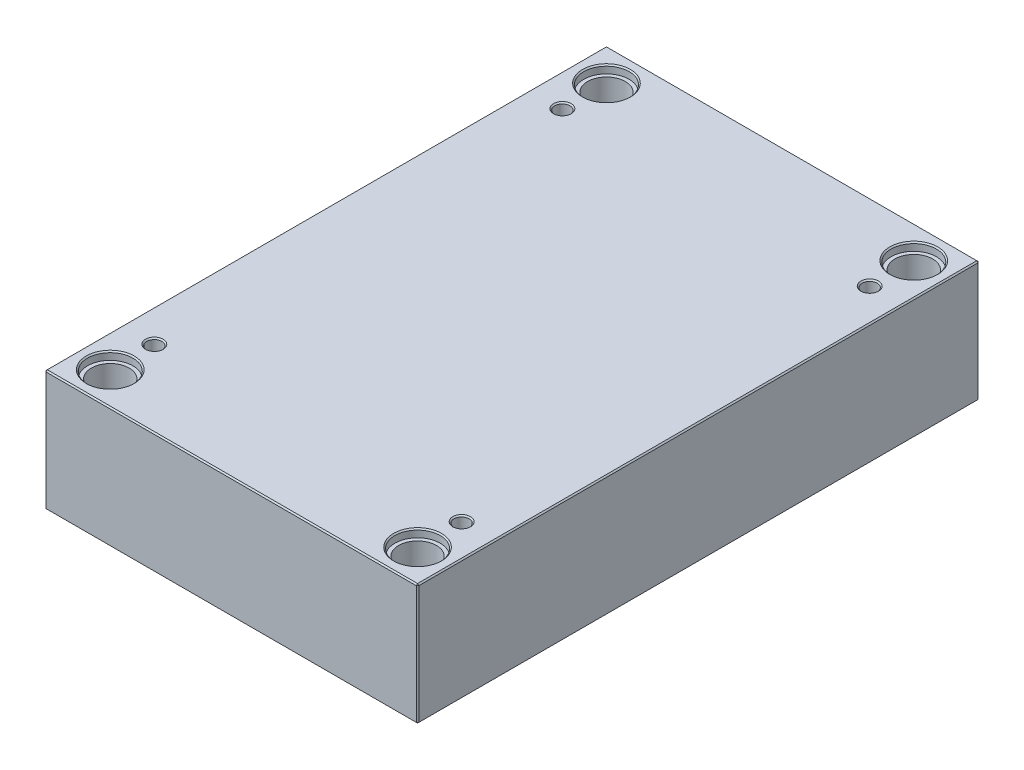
ISO-10303-21;
HEADER;
FILE_DESCRIPTION(('STEP AP214'),'2;1');
FILE_NAME('part.step','',(''),(''),'','','');
FILE_SCHEMA(('AUTOMOTIVE_DESIGN { 1 0 10303 214 1 1 1 1 }'));
ENDSEC;
DATA;
#1=APPLICATION_CONTEXT('core data for automotive mechanical design processes');
#2=APPLICATION_PROTOCOL_DEFINITION('international standard','automotive_design',2000,#1);
#3=PRODUCT_CONTEXT('',#1,'mechanical');
#4=PRODUCT('Part','Part','',(#3));
#5=PRODUCT_RELATED_PRODUCT_CATEGORY('part','',(#4));
#6=PRODUCT_DEFINITION_FORMATION('','',#4);
#7=PRODUCT_DEFINITION_CONTEXT('part definition',#1,'design');
#8=PRODUCT_DEFINITION('design','',#6,#7);
#9=PRODUCT_DEFINITION_SHAPE('','',#8);
#10=(LENGTH_UNIT() NAMED_UNIT(*) SI_UNIT(.MILLI.,.METRE.));
#11=(NAMED_UNIT(*) PLANE_ANGLE_UNIT() SI_UNIT($,.RADIAN.));
#12=(NAMED_UNIT(*) SI_UNIT($,.STERADIAN.) SOLID_ANGLE_UNIT());
#13=UNCERTAINTY_MEASURE_WITH_UNIT(LENGTH_MEASURE(1.E-05),#10,'distance_accuracy_value','');
#14=(GEOMETRIC_REPRESENTATION_CONTEXT(3) GLOBAL_UNCERTAINTY_ASSIGNED_CONTEXT((#13)) GLOBAL_UNIT_ASSIGNED_CONTEXT((#10,
#11,#12)) REPRESENTATION_CONTEXT('',''));
#15=CARTESIAN_POINT('',(0.,0.,0.));
#16=DIRECTION('',(0.,0.,1.));
#17=DIRECTION('',(1.,0.,0.));
#18=AXIS2_PLACEMENT_3D('',#15,#16,#17);
#19=CARTESIAN_POINT('',(-122.,0.,-197.));
#20=DIRECTION('',(0.,1.,0.));
#21=DIRECTION('',(0.,0.,1.));
#22=AXIS2_PLACEMENT_3D('',#19,#20,#21);
#23=CYLINDRICAL_SURFACE('',#22,15.);
#24=CARTESIAN_POINT('',(-122.,1.,-197.));
#25=DIRECTION('',(0.,1.,0.));
#26=DIRECTION('',(0.,0.,1.));
#27=AXIS2_PLACEMENT_3D('',#24,#25,#26);
#28=CIRCLE('',#27,15.);
#29=CARTESIAN_POINT('',(-122.,1.,-182.));
#30=VERTEX_POINT('',#29);
#31=EDGE_CURVE('E472',#30,#30,#28,.F.);
#32=ORIENTED_EDGE('',*,*,#31,.T.);
#33=EDGE_LOOP('',(#32));
#34=FACE_BOUND('',#33,.T.);
#35=CARTESIAN_POINT('',(-122.,89.7,-197.));
#36=DIRECTION('',(0.,1.,0.));
#37=DIRECTION('',(0.,0.,1.));
#38=AXIS2_PLACEMENT_3D('',#35,#36,#37);
#39=CIRCLE('',#38,15.);
#40=CARTESIAN_POINT('',(-122.,89.7,-182.));
#41=VERTEX_POINT('',#40);
#42=EDGE_CURVE('E221',#41,#41,#39,.F.);
#43=ORIENTED_EDGE('',*,*,#42,.F.);
#44=EDGE_LOOP('',(#43));
#45=FACE_BOUND('',#44,.T.);
#46=ADVANCED_FACE('F16',(#34,#45),#23,.F.);
#47=CARTESIAN_POINT('',(122.,0.,-197.));
#48=DIRECTION('',(0.,1.,0.));
#49=DIRECTION('',(0.,0.,1.));
#50=AXIS2_PLACEMENT_3D('',#47,#48,#49);
#51=CYLINDRICAL_SURFACE('',#50,15.);
#52=CARTESIAN_POINT('',(122.,1.00000000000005,-197.));
#53=DIRECTION('',(0.,1.,0.));
#54=DIRECTION('',(0.,0.,1.));
#55=AXIS2_PLACEMENT_3D('',#52,#53,#54);
#56=CIRCLE('',#55,15.);
#57=CARTESIAN_POINT('',(122.,1.00000000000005,-182.));
#58=VERTEX_POINT('',#57);
#59=EDGE_CURVE('E474',#58,#58,#56,.F.);
#60=ORIENTED_EDGE('',*,*,#59,.T.);
#61=EDGE_LOOP('',(#60));
#62=FACE_BOUND('',#61,.T.);
#63=CARTESIAN_POINT('',(122.,89.7,-197.));
#64=DIRECTION('',(0.,1.,0.));
#65=DIRECTION('',(0.,0.,1.));
#66=AXIS2_PLACEMENT_3D('',#63,#64,#65);
#67=CIRCLE('',#66,15.);
#68=CARTESIAN_POINT('',(122.,89.7,-182.));
#69=VERTEX_POINT('',#68);
#70=EDGE_CURVE('E218',#69,#69,#67,.F.);
#71=ORIENTED_EDGE('',*,*,#70,.F.);
#72=EDGE_LOOP('',(#71));
#73=FACE_BOUND('',#72,.T.);
#74=ADVANCED_FACE('F263',(#62,#73),#51,.F.);
#75=CARTESIAN_POINT('',(122.,0.,197.));
#76=DIRECTION('',(0.,1.,0.));
#77=DIRECTION('',(0.,0.,1.));
#78=AXIS2_PLACEMENT_3D('',#75,#76,#77);
#79=CYLINDRICAL_SURFACE('',#78,15.);
#80=CARTESIAN_POINT('',(122.,1.00000000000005,197.));
#81=DIRECTION('',(0.,1.,0.));
#82=DIRECTION('',(0.,0.,1.));
#83=AXIS2_PLACEMENT_3D('',#80,#81,#82);
#84=CIRCLE('',#83,15.);
#85=CARTESIAN_POINT('',(122.,1.00000000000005,212.));
#86=VERTEX_POINT('',#85);
#87=EDGE_CURVE('E477',#86,#86,#84,.F.);
#88=ORIENTED_EDGE('',*,*,#87,.T.);
#89=EDGE_LOOP('',(#88));
#90=FACE_BOUND('',#89,.T.);
#91=CARTESIAN_POINT('',(122.,89.7,197.));
#92=DIRECTION('',(0.,1.,0.));
#93=DIRECTION('',(0.,0.,1.));
#94=AXIS2_PLACEMENT_3D('',#91,#92,#93);
#95=CIRCLE('',#94,15.);
#96=CARTESIAN_POINT('',(122.,89.7,212.));
#97=VERTEX_POINT('',#96);
#98=EDGE_CURVE('E214',#97,#97,#95,.F.);
#99=ORIENTED_EDGE('',*,*,#98,.F.);
#100=EDGE_LOOP('',(#99));
#101=FACE_BOUND('',#100,.T.);
#102=ADVANCED_FACE('F270',(#90,#101),#79,.F.);
#103=CARTESIAN_POINT('',(-122.,0.,197.));
#104=DIRECTION('',(0.,1.,0.));
#105=DIRECTION('',(0.,0.,1.));
#106=AXIS2_PLACEMENT_3D('',#103,#104,#105);
#107=CYLINDRICAL_SURFACE('',#106,15.);
#108=CARTESIAN_POINT('',(-122.,1.,197.));
#109=DIRECTION('',(0.,1.,0.));
#110=DIRECTION('',(0.,0.,1.));
#111=AXIS2_PLACEMENT_3D('',#108,#109,#110);
#112=CIRCLE('',#111,15.);
#113=CARTESIAN_POINT('',(-122.,1.,212.));
#114=VERTEX_POINT('',#113);
#115=EDGE_CURVE('E480',#114,#114,#112,.F.);
#116=ORIENTED_EDGE('',*,*,#115,.T.);
#117=EDGE_LOOP('',(#116));
#118=FACE_BOUND('',#117,.T.);
#119=CARTESIAN_POINT('',(-122.,89.7,197.));
#120=DIRECTION('',(0.,1.,0.));
#121=DIRECTION('',(0.,0.,1.));
#122=AXIS2_PLACEMENT_3D('',#119,#120,#121);
#123=CIRCLE('',#122,15.);
#124=CARTESIAN_POINT('',(-122.,89.7,212.));
#125=VERTEX_POINT('',#124);
#126=EDGE_CURVE('E211',#125,#125,#123,.F.);
#127=ORIENTED_EDGE('',*,*,#126,.F.);
#128=EDGE_LOOP('',(#127));
#129=FACE_BOUND('',#128,.T.);
#130=ADVANCED_FACE('F277',(#118,#129),#107,.F.);
#131=CARTESIAN_POINT('',(-148.,96.,223.));
#132=DIRECTION('',(1.,0.,0.));
#133=DIRECTION('',(0.,0.,-1.));
#134=AXIS2_PLACEMENT_3D('',#131,#132,#133);
#135=PLANE('',#134);
#136=DIRECTION('',(0.,-1.,0.));
#137=VECTOR('',#136,1.);
#138=CARTESIAN_POINT('',(-148.,96.,-222.));
#139=LINE('',#138,#137);
#140=CARTESIAN_POINT('',(-148.,95.,-222.));
#141=VERTEX_POINT('',#140);
#142=CARTESIAN_POINT('',(-148.,1.,-222.));
#143=VERTEX_POINT('',#142);
#144=EDGE_CURVE('E487',#141,#143,#139,.T.);
#145=ORIENTED_EDGE('',*,*,#144,.T.);
#146=DIRECTION('',(0.,0.,1.));
#147=VECTOR('',#146,1.);
#148=CARTESIAN_POINT('',(-148.,1.,223.));
#149=LINE('',#148,#147);
#150=CARTESIAN_POINT('',(-148.,1.,222.));
#151=VERTEX_POINT('',#150);
#152=EDGE_CURVE('E490',#143,#151,#149,.T.);
#153=ORIENTED_EDGE('',*,*,#152,.T.);
#154=DIRECTION('',(0.,1.,0.));
#155=VECTOR('',#154,1.);
#156=CARTESIAN_POINT('',(-148.,96.,222.));
#157=LINE('',#156,#155);
#158=CARTESIAN_POINT('',(-148.,95.,222.));
#159=VERTEX_POINT('',#158);
#160=EDGE_CURVE('E485',#151,#159,#157,.T.);
#161=ORIENTED_EDGE('',*,*,#160,.T.);
#162=DIRECTION('',(0.,0.,-1.));
#163=VECTOR('',#162,1.);
#164=CARTESIAN_POINT('',(-148.,95.,-223.));
#165=LINE('',#164,#163);
#166=EDGE_CURVE('E483',#159,#141,#165,.T.);
#167=ORIENTED_EDGE('',*,*,#166,.T.);
#168=EDGE_LOOP('',(#145,#153,#161,#167));
#169=FACE_BOUND('',#168,.T.);
#170=ADVANCED_FACE('F298',(#169),#135,.F.);
#171=CARTESIAN_POINT('',(148.,96.,223.));
#172=DIRECTION('',(0.,0.,-1.));
#173=DIRECTION('',(-1.,0.,0.));
#174=AXIS2_PLACEMENT_3D('',#171,#172,#173);
#175=PLANE('',#174);
#176=DIRECTION('',(-1.,0.,0.));
#177=VECTOR('',#176,1.);
#178=CARTESIAN_POINT('',(-148.,95.,223.));
#179=LINE('',#178,#177);
#180=CARTESIAN_POINT('',(147.,95.,223.));
#181=VERTEX_POINT('',#180);
#182=CARTESIAN_POINT('',(-147.,95.,223.));
#183=VERTEX_POINT('',#182);
#184=EDGE_CURVE('E509',#181,#183,#179,.T.);
#185=ORIENTED_EDGE('',*,*,#184,.T.);
#186=DIRECTION('',(0.,-1.,0.));
#187=VECTOR('',#186,1.);
#188=CARTESIAN_POINT('',(-147.,96.,223.));
#189=LINE('',#188,#187);
#190=CARTESIAN_POINT('',(-147.,1.,223.));
#191=VERTEX_POINT('',#190);
#192=EDGE_CURVE('E515',#183,#191,#189,.T.);
#193=ORIENTED_EDGE('',*,*,#192,.T.);
#194=DIRECTION('',(1.,0.,0.));
#195=VECTOR('',#194,1.);
#196=CARTESIAN_POINT('',(148.,1.,223.));
#197=LINE('',#196,#195);
#198=CARTESIAN_POINT('',(147.,1.,223.));
#199=VERTEX_POINT('',#198);
#200=EDGE_CURVE('E513',#191,#199,#197,.T.);
#201=ORIENTED_EDGE('',*,*,#200,.T.);
#202=DIRECTION('',(0.,1.,0.));
#203=VECTOR('',#202,1.);
#204=CARTESIAN_POINT('',(147.,96.,223.));
#205=LINE('',#204,#203);
#206=EDGE_CURVE('E511',#199,#181,#205,.T.);
#207=ORIENTED_EDGE('',*,*,#206,.T.);
#208=EDGE_LOOP('',(#185,#193,#201,#207));
#209=FACE_BOUND('',#208,.T.);
#210=ADVANCED_FACE('F294',(#209),#175,.F.);
#211=CARTESIAN_POINT('',(148.,96.,223.));
#212=DIRECTION('',(-1.,0.,0.));
#213=DIRECTION('',(0.,0.,1.));
#214=AXIS2_PLACEMENT_3D('',#211,#212,#213);
#215=PLANE('',#214);
#216=DIRECTION('',(0.,0.,-1.));
#217=VECTOR('',#216,1.);
#218=CARTESIAN_POINT('',(148.,1.,223.));
#219=LINE('',#218,#217);
#220=CARTESIAN_POINT('',(148.,1.,222.));
#221=VERTEX_POINT('',#220);
#222=CARTESIAN_POINT('',(148.,1.,-222.));
#223=VERTEX_POINT('',#222);
#224=EDGE_CURVE('E504',#221,#223,#219,.T.);
#225=ORIENTED_EDGE('',*,*,#224,.T.);
#226=DIRECTION('',(0.,1.,0.));
#227=VECTOR('',#226,1.);
#228=CARTESIAN_POINT('',(148.,96.,-222.));
#229=LINE('',#228,#227);
#230=CARTESIAN_POINT('',(148.,95.,-222.));
#231=VERTEX_POINT('',#230);
#232=EDGE_CURVE('E506',#223,#231,#229,.T.);
#233=ORIENTED_EDGE('',*,*,#232,.T.);
#234=DIRECTION('',(0.,0.,1.));
#235=VECTOR('',#234,1.);
#236=CARTESIAN_POINT('',(148.,95.,223.));
#237=LINE('',#236,#235);
#238=CARTESIAN_POINT('',(148.,95.,222.));
#239=VERTEX_POINT('',#238);
#240=EDGE_CURVE('E500',#231,#239,#237,.T.);
#241=ORIENTED_EDGE('',*,*,#240,.T.);
#242=DIRECTION('',(0.,-1.,0.));
#243=VECTOR('',#242,1.);
#244=CARTESIAN_POINT('',(148.,96.,222.));
#245=LINE('',#244,#243);
#246=EDGE_CURVE('E502',#239,#221,#245,.T.);
#247=ORIENTED_EDGE('',*,*,#246,.T.);
#248=EDGE_LOOP('',(#225,#233,#241,#247));
#249=FACE_BOUND('',#248,.T.);
#250=ADVANCED_FACE('F290',(#249),#215,.F.);
#251=CARTESIAN_POINT('',(148.,96.,-223.));
#252=DIRECTION('',(0.,0.,1.));
#253=DIRECTION('',(1.,0.,0.));
#254=AXIS2_PLACEMENT_3D('',#251,#252,#253);
#255=PLANE('',#254);
#256=DIRECTION('',(0.,-1.,0.));
#257=VECTOR('',#256,1.);
#258=CARTESIAN_POINT('',(147.,96.,-223.));
#259=LINE('',#258,#257);
#260=CARTESIAN_POINT('',(147.,95.,-223.));
#261=VERTEX_POINT('',#260);
#262=CARTESIAN_POINT('',(147.,1.,-223.));
#263=VERTEX_POINT('',#262);
#264=EDGE_CURVE('E494',#261,#263,#259,.T.);
#265=ORIENTED_EDGE('',*,*,#264,.T.);
#266=DIRECTION('',(-1.,0.,0.));
#267=VECTOR('',#266,1.);
#268=CARTESIAN_POINT('',(148.,1.,-223.));
#269=LINE('',#268,#267);
#270=CARTESIAN_POINT('',(-147.,1.,-223.));
#271=VERTEX_POINT('',#270);
#272=EDGE_CURVE('E138',#263,#271,#269,.T.);
#273=ORIENTED_EDGE('',*,*,#272,.T.);
#274=DIRECTION('',(0.,1.,0.));
#275=VECTOR('',#274,1.);
#276=CARTESIAN_POINT('',(-147.,96.,-223.));
#277=LINE('',#276,#275);
#278=CARTESIAN_POINT('',(-147.,95.,-223.));
#279=VERTEX_POINT('',#278);
#280=EDGE_CURVE('E496',#271,#279,#277,.T.);
#281=ORIENTED_EDGE('',*,*,#280,.T.);
#282=DIRECTION('',(1.,0.,0.));
#283=VECTOR('',#282,1.);
#284=CARTESIAN_POINT('',(148.,95.,-223.));
#285=LINE('',#284,#283);
#286=EDGE_CURVE('E492',#279,#261,#285,.T.);
#287=ORIENTED_EDGE('',*,*,#286,.T.);
#288=EDGE_LOOP('',(#265,#273,#281,#287));
#289=FACE_BOUND('',#288,.T.);
#290=ADVANCED_FACE('F282',(#289),#255,.F.);
#291=CARTESIAN_POINT('',(0.,96.,0.));
#292=DIRECTION('',(0.,1.,0.));
#293=DIRECTION('',(0.,0.,1.));
#294=AXIS2_PLACEMENT_3D('',#291,#292,#293);
#295=PLANE('',#294);
#296=CARTESIAN_POINT('',(122.,96.,197.));
#297=DIRECTION('',(0.,1.,0.));
#298=DIRECTION('',(0.,0.,1.));
#299=AXIS2_PLACEMENT_3D('',#296,#297,#298);
#300=CIRCLE('',#299,19.);
#301=CARTESIAN_POINT('',(122.,96.,216.));
#302=VERTEX_POINT('',#301);
#303=EDGE_CURVE('E236',#302,#302,#300,.F.);
#304=ORIENTED_EDGE('',*,*,#303,.T.);
#305=EDGE_LOOP('',(#304));
#306=FACE_BOUND('',#305,.T.);
#307=CARTESIAN_POINT('',(-122.,96.,197.));
#308=DIRECTION('',(0.,1.,0.));
#309=DIRECTION('',(0.,0.,1.));
#310=AXIS2_PLACEMENT_3D('',#307,#308,#309);
#311=CIRCLE('',#310,19.);
#312=CARTESIAN_POINT('',(-122.,96.,216.));
#313=VERTEX_POINT('',#312);
#314=EDGE_CURVE('E233',#313,#313,#311,.F.);
#315=ORIENTED_EDGE('',*,*,#314,.T.);
#316=EDGE_LOOP('',(#315));
#317=FACE_BOUND('',#316,.T.);
#318=CARTESIAN_POINT('',(122.,96.,-197.));
#319=DIRECTION('',(0.,1.,0.));
#320=DIRECTION('',(0.,0.,1.));
#321=AXIS2_PLACEMENT_3D('',#318,#319,#320);
#322=CIRCLE('',#321,19.);
#323=CARTESIAN_POINT('',(122.,96.,-178.));
#324=VERTEX_POINT('',#323);
#325=EDGE_CURVE('E230',#324,#324,#322,.F.);
#326=ORIENTED_EDGE('',*,*,#325,.T.);
#327=EDGE_LOOP('',(#326));
#328=FACE_BOUND('',#327,.T.);
#329=CARTESIAN_POINT('',(-122.,96.,-197.));
#330=DIRECTION('',(0.,1.,0.));
#331=DIRECTION('',(0.,0.,1.));
#332=AXIS2_PLACEMENT_3D('',#329,#330,#331);
#333=CIRCLE('',#332,19.);
#334=CARTESIAN_POINT('',(-122.,96.,-178.));
#335=VERTEX_POINT('',#334);
#336=EDGE_CURVE('E227',#335,#335,#333,.F.);
#337=ORIENTED_EDGE('',*,*,#336,.T.);
#338=EDGE_LOOP('',(#337));
#339=FACE_BOUND('',#338,.T.);
#340=CARTESIAN_POINT('',(-122.,96.,162.));
#341=DIRECTION('',(0.,1.,0.));
#342=DIRECTION('',(0.,0.,1.));
#343=AXIS2_PLACEMENT_3D('',#340,#341,#342);
#344=CIRCLE('',#343,7.);
#345=CARTESIAN_POINT('',(-122.,96.,169.));
#346=VERTEX_POINT('',#345);
#347=EDGE_CURVE('E198',#346,#346,#344,.F.);
#348=ORIENTED_EDGE('',*,*,#347,.T.);
#349=EDGE_LOOP('',(#348));
#350=FACE_BOUND('',#349,.T.);
#351=CARTESIAN_POINT('',(122.,96.,162.));
#352=DIRECTION('',(0.,1.,0.));
#353=DIRECTION('',(0.,0.,1.));
#354=AXIS2_PLACEMENT_3D('',#351,#352,#353);
#355=CIRCLE('',#354,7.00000000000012);
#356=CARTESIAN_POINT('',(122.,96.,169.));
#357=VERTEX_POINT('',#356);
#358=EDGE_CURVE('E195',#357,#357,#355,.F.);
#359=ORIENTED_EDGE('',*,*,#358,.T.);
#360=EDGE_LOOP('',(#359));
#361=FACE_BOUND('',#360,.T.);
#362=CARTESIAN_POINT('',(122.,96.,-162.));
#363=DIRECTION('',(0.,1.,0.));
#364=DIRECTION('',(0.,0.,1.));
#365=AXIS2_PLACEMENT_3D('',#362,#363,#364);
#366=CIRCLE('',#365,7.00000000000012);
#367=CARTESIAN_POINT('',(122.,96.,-155.));
#368=VERTEX_POINT('',#367);
#369=EDGE_CURVE('E192',#368,#368,#366,.F.);
#370=ORIENTED_EDGE('',*,*,#369,.T.);
#371=EDGE_LOOP('',(#370));
#372=FACE_BOUND('',#371,.T.);
#373=CARTESIAN_POINT('',(-122.,96.,-162.));
#374=DIRECTION('',(0.,1.,0.));
#375=DIRECTION('',(0.,0.,1.));
#376=AXIS2_PLACEMENT_3D('',#373,#374,#375);
#377=CIRCLE('',#376,7.);
#378=CARTESIAN_POINT('',(-122.,96.,-155.));
#379=VERTEX_POINT('',#378);
#380=EDGE_CURVE('E188',#379,#379,#377,.F.);
#381=ORIENTED_EDGE('',*,*,#380,.T.);
#382=EDGE_LOOP('',(#381));
#383=FACE_BOUND('',#382,.T.);
#384=DIRECTION('',(0.,0.,-1.));
#385=VECTOR('',#384,1.);
#386=CARTESIAN_POINT('',(147.,96.,-223.));
#387=LINE('',#386,#385);
#388=CARTESIAN_POINT('',(147.,96.,222.));
#389=VERTEX_POINT('',#388);
#390=CARTESIAN_POINT('',(147.,96.,-222.));
#391=VERTEX_POINT('',#390);
#392=EDGE_CURVE('E31',#389,#391,#387,.T.);
#393=ORIENTED_EDGE('',*,*,#392,.T.);
#394=DIRECTION('',(-1.,0.,0.));
#395=VECTOR('',#394,1.);
#396=CARTESIAN_POINT('',(-148.,96.,-222.));
#397=LINE('',#396,#395);
#398=CARTESIAN_POINT('',(-147.,96.,-222.));
#399=VERTEX_POINT('',#398);
#400=EDGE_CURVE('E189',#391,#399,#397,.T.);
#401=ORIENTED_EDGE('',*,*,#400,.T.);
#402=DIRECTION('',(0.,0.,1.));
#403=VECTOR('',#402,1.);
#404=CARTESIAN_POINT('',(-147.,96.,223.));
#405=LINE('',#404,#403);
#406=CARTESIAN_POINT('',(-147.,96.,222.));
#407=VERTEX_POINT('',#406);
#408=EDGE_CURVE('E518',#399,#407,#405,.T.);
#409=ORIENTED_EDGE('',*,*,#408,.T.);
#410=DIRECTION('',(1.,0.,0.));
#411=VECTOR('',#410,1.);
#412=CARTESIAN_POINT('',(148.,96.,222.));
#413=LINE('',#412,#411);
#414=EDGE_CURVE('E36',#407,#389,#413,.T.);
#415=ORIENTED_EDGE('',*,*,#414,.T.);
#416=EDGE_LOOP('',(#393,#401,#409,#415));
#417=FACE_BOUND('',#416,.T.);
#418=ADVANCED_FACE('F279',(#306,#317,#328,#339,#350,#361,#372,#383,#417),#295,.T.);
#419=CARTESIAN_POINT('',(0.,0.,0.));
#420=DIRECTION('',(0.,1.,0.));
#421=DIRECTION('',(0.,0.,1.));
#422=AXIS2_PLACEMENT_3D('',#419,#420,#421);
#423=PLANE('',#422);
#424=CARTESIAN_POINT('',(-122.,0.,-197.));
#425=DIRECTION('',(0.,1.,0.));
#426=DIRECTION('',(0.,0.,1.));
#427=AXIS2_PLACEMENT_3D('',#424,#425,#426);
#428=CIRCLE('',#427,16.);
#429=CARTESIAN_POINT('',(-122.,0.,-181.));
#430=VERTEX_POINT('',#429);
#431=EDGE_CURVE('E469',#430,#430,#428,.T.);
#432=ORIENTED_EDGE('',*,*,#431,.T.);
#433=EDGE_LOOP('',(#432));
#434=FACE_BOUND('',#433,.T.);
#435=CARTESIAN_POINT('',(122.,0.,-197.));
#436=DIRECTION('',(0.,1.,0.));
#437=DIRECTION('',(0.,0.,1.));
#438=AXIS2_PLACEMENT_3D('',#435,#436,#437);
#439=CIRCLE('',#438,16.);
#440=CARTESIAN_POINT('',(122.,0.,-181.));
#441=VERTEX_POINT('',#440);
#442=EDGE_CURVE('E466',#441,#441,#439,.T.);
#443=ORIENTED_EDGE('',*,*,#442,.T.);
#444=EDGE_LOOP('',(#443));
#445=FACE_BOUND('',#444,.T.);
#446=CARTESIAN_POINT('',(122.,0.,197.));
#447=DIRECTION('',(0.,1.,0.));
#448=DIRECTION('',(0.,0.,1.));
#449=AXIS2_PLACEMENT_3D('',#446,#447,#448);
#450=CIRCLE('',#449,16.);
#451=CARTESIAN_POINT('',(122.,0.,213.));
#452=VERTEX_POINT('',#451);
#453=EDGE_CURVE('E463',#452,#452,#450,.T.);
#454=ORIENTED_EDGE('',*,*,#453,.T.);
#455=EDGE_LOOP('',(#454));
#456=FACE_BOUND('',#455,.T.);
#457=CARTESIAN_POINT('',(-122.,0.,197.));
#458=DIRECTION('',(0.,1.,0.));
#459=DIRECTION('',(0.,0.,1.));
#460=AXIS2_PLACEMENT_3D('',#457,#458,#459);
#461=CIRCLE('',#460,16.);
#462=CARTESIAN_POINT('',(-122.,0.,213.));
#463=VERTEX_POINT('',#462);
#464=EDGE_CURVE('E460',#463,#463,#461,.T.);
#465=ORIENTED_EDGE('',*,*,#464,.T.);
#466=EDGE_LOOP('',(#465));
#467=FACE_BOUND('',#466,.T.);
#468=DIRECTION('',(0.,0.,1.));
#469=VECTOR('',#468,1.);
#470=CARTESIAN_POINT('',(147.,0.,0.));
#471=LINE('',#470,#469);
#472=CARTESIAN_POINT('',(147.,0.,-222.));
#473=VERTEX_POINT('',#472);
#474=CARTESIAN_POINT('',(147.,0.,222.));
#475=VERTEX_POINT('',#474);
#476=EDGE_CURVE('E108',#473,#475,#471,.T.);
#477=ORIENTED_EDGE('',*,*,#476,.T.);
#478=DIRECTION('',(-1.,0.,0.));
#479=VECTOR('',#478,1.);
#480=CARTESIAN_POINT('',(0.,0.,222.));
#481=LINE('',#480,#479);
#482=CARTESIAN_POINT('',(-147.,0.,222.));
#483=VERTEX_POINT('',#482);
#484=EDGE_CURVE('E458',#475,#483,#481,.T.);
#485=ORIENTED_EDGE('',*,*,#484,.T.);
#486=DIRECTION('',(0.,0.,-1.));
#487=VECTOR('',#486,1.);
#488=CARTESIAN_POINT('',(-147.,0.,0.));
#489=LINE('',#488,#487);
#490=CARTESIAN_POINT('',(-147.,0.,-222.));
#491=VERTEX_POINT('',#490);
#492=EDGE_CURVE('E110',#483,#491,#489,.T.);
#493=ORIENTED_EDGE('',*,*,#492,.T.);
#494=DIRECTION('',(1.,0.,0.));
#495=VECTOR('',#494,1.);
#496=CARTESIAN_POINT('',(0.,0.,-222.));
#497=LINE('',#496,#495);
#498=EDGE_CURVE('E104',#491,#473,#497,.T.);
#499=ORIENTED_EDGE('',*,*,#498,.T.);
#500=EDGE_LOOP('',(#477,#485,#493,#499));
#501=FACE_BOUND('',#500,.T.);
#502=ADVANCED_FACE('F106',(#434,#445,#456,#467,#501),#423,.F.);
#503=CARTESIAN_POINT('',(-122.,0.,-197.));
#504=DIRECTION('',(0.,-1.,0.));
#505=DIRECTION('',(0.,0.,-1.));
#506=AXIS2_PLACEMENT_3D('',#503,#504,#505);
#507=CONICAL_SURFACE('',#506,16.,0.78539816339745);
#508=ORIENTED_EDGE('',*,*,#31,.F.);
#509=EDGE_LOOP('',(#508));
#510=FACE_BOUND('',#509,.T.);
#511=ORIENTED_EDGE('',*,*,#431,.F.);
#512=EDGE_LOOP('',(#511));
#513=FACE_BOUND('',#512,.T.);
#514=ADVANCED_FACE('F286',(#510,#513),#507,.F.);
#515=CARTESIAN_POINT('',(122.,0.,-197.));
#516=DIRECTION('',(0.,-1.,0.));
#517=DIRECTION('',(0.,0.,-1.));
#518=AXIS2_PLACEMENT_3D('',#515,#516,#517);
#519=CONICAL_SURFACE('',#518,16.,0.78539816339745);
#520=ORIENTED_EDGE('',*,*,#59,.F.);
#521=EDGE_LOOP('',(#520));
#522=FACE_BOUND('',#521,.T.);
#523=ORIENTED_EDGE('',*,*,#442,.F.);
#524=EDGE_LOOP('',(#523));
#525=FACE_BOUND('',#524,.T.);
#526=ADVANCED_FACE('F305',(#522,#525),#519,.F.);
#527=CARTESIAN_POINT('',(122.,0.,197.));
#528=DIRECTION('',(0.,-1.,0.));
#529=DIRECTION('',(0.,0.,-1.));
#530=AXIS2_PLACEMENT_3D('',#527,#528,#529);
#531=CONICAL_SURFACE('',#530,16.,0.78539816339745);
#532=ORIENTED_EDGE('',*,*,#87,.F.);
#533=EDGE_LOOP('',(#532));
#534=FACE_BOUND('',#533,.T.);
#535=ORIENTED_EDGE('',*,*,#453,.F.);
#536=EDGE_LOOP('',(#535));
#537=FACE_BOUND('',#536,.T.);
#538=ADVANCED_FACE('F309',(#534,#537),#531,.F.);
#539=CARTESIAN_POINT('',(-122.,0.,197.));
#540=DIRECTION('',(0.,-1.,0.));
#541=DIRECTION('',(0.,0.,-1.));
#542=AXIS2_PLACEMENT_3D('',#539,#540,#541);
#543=CONICAL_SURFACE('',#542,16.,0.78539816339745);
#544=ORIENTED_EDGE('',*,*,#115,.F.);
#545=EDGE_LOOP('',(#544));
#546=FACE_BOUND('',#545,.T.);
#547=ORIENTED_EDGE('',*,*,#464,.F.);
#548=EDGE_LOOP('',(#547));
#549=FACE_BOUND('',#548,.T.);
#550=ADVANCED_FACE('F313',(#546,#549),#543,.F.);
#551=CARTESIAN_POINT('',(148.,96.,222.));
#552=DIRECTION('',(-0.707106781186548,0.,-0.707106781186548));
#553=DIRECTION('',(0.,-1.,0.));
#554=AXIS2_PLACEMENT_3D('',#551,#552,#553);
#555=PLANE('',#554);
#556=DIRECTION('',(-0.707106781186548,0.,0.707106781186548));
#557=VECTOR('',#556,1.);
#558=CARTESIAN_POINT('',(147.,95.,223.));
#559=LINE('',#558,#557);
#560=EDGE_CURVE('E126',#181,#239,#559,.F.);
#561=ORIENTED_EDGE('',*,*,#560,.F.);
#562=ORIENTED_EDGE('',*,*,#206,.F.);
#563=DIRECTION('',(0.707106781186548,0.,-0.707106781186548));
#564=VECTOR('',#563,1.);
#565=CARTESIAN_POINT('',(147.,1.,223.));
#566=LINE('',#565,#564);
#567=EDGE_CURVE('E180',#221,#199,#566,.F.);
#568=ORIENTED_EDGE('',*,*,#567,.F.);
#569=ORIENTED_EDGE('',*,*,#246,.F.);
#570=EDGE_LOOP('',(#561,#562,#568,#569));
#571=FACE_BOUND('',#570,.T.);
#572=ADVANCED_FACE('F317',(#571),#555,.F.);
#573=CARTESIAN_POINT('',(147.,95.,223.));
#574=DIRECTION('',(0.577350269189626,0.577350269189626,0.577350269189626));
#575=DIRECTION('',(0.707106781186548,0.,-0.707106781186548));
#576=AXIS2_PLACEMENT_3D('',#573,#574,#575);
#577=PLANE('',#576);
#578=DIRECTION('',(0.,-0.707106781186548,0.707106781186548));
#579=VECTOR('',#578,1.);
#580=CARTESIAN_POINT('',(147.,95.,223.));
#581=LINE('',#580,#579);
#582=EDGE_CURVE('E175',#181,#389,#581,.F.);
#583=ORIENTED_EDGE('',*,*,#582,.F.);
#584=ORIENTED_EDGE('',*,*,#560,.T.);
#585=DIRECTION('',(-0.707106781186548,0.707106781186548,0.));
#586=VECTOR('',#585,1.);
#587=CARTESIAN_POINT('',(147.5,95.5,222.));
#588=LINE('',#587,#586);
#589=EDGE_CURVE('E177',#389,#239,#588,.F.);
#590=ORIENTED_EDGE('',*,*,#589,.F.);
#591=EDGE_LOOP('',(#583,#584,#590));
#592=FACE_BOUND('',#591,.T.);
#593=ADVANCED_FACE('F385',(#592),#577,.T.);
#594=CARTESIAN_POINT('',(147.,1.,223.));
#595=DIRECTION('',(0.577350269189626,-0.577350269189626,0.577350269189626));
#596=DIRECTION('',(0.707106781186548,0.,-0.707106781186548));
#597=AXIS2_PLACEMENT_3D('',#594,#595,#596);
#598=PLANE('',#597);
#599=DIRECTION('',(-0.707106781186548,-0.707106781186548,0.));
#600=VECTOR('',#599,1.);
#601=CARTESIAN_POINT('',(147.5,0.5,222.));
#602=LINE('',#601,#600);
#603=EDGE_CURVE('E124',#221,#475,#602,.T.);
#604=ORIENTED_EDGE('',*,*,#603,.F.);
#605=ORIENTED_EDGE('',*,*,#567,.T.);
#606=DIRECTION('',(0.,0.707106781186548,0.707106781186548));
#607=VECTOR('',#606,1.);
#608=CARTESIAN_POINT('',(147.,1.,223.));
#609=LINE('',#608,#607);
#610=EDGE_CURVE('E172',#475,#199,#609,.T.);
#611=ORIENTED_EDGE('',*,*,#610,.F.);
#612=EDGE_LOOP('',(#604,#605,#611));
#613=FACE_BOUND('',#612,.T.);
#614=ADVANCED_FACE('F381',(#613),#598,.T.);
#615=CARTESIAN_POINT('',(147.,96.,0.));
#616=DIRECTION('',(0.707106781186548,0.707106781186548,0.));
#617=DIRECTION('',(0.,0.,1.));
#618=AXIS2_PLACEMENT_3D('',#615,#616,#617);
#619=PLANE('',#618);
#620=ORIENTED_EDGE('',*,*,#589,.T.);
#621=ORIENTED_EDGE('',*,*,#240,.F.);
#622=DIRECTION('',(0.707106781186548,-0.707106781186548,0.));
#623=VECTOR('',#622,1.);
#624=CARTESIAN_POINT('',(148.,95.,-222.));
#625=LINE('',#624,#623);
#626=EDGE_CURVE('E166',#391,#231,#625,.T.);
#627=ORIENTED_EDGE('',*,*,#626,.F.);
#628=ORIENTED_EDGE('',*,*,#392,.F.);
#629=EDGE_LOOP('',(#620,#621,#627,#628));
#630=FACE_BOUND('',#629,.T.);
#631=ADVANCED_FACE('F377',(#630),#619,.T.);
#632=CARTESIAN_POINT('',(0.,96.,222.));
#633=DIRECTION('',(0.,0.707106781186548,0.707106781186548));
#634=DIRECTION('',(-1.,0.,0.));
#635=AXIS2_PLACEMENT_3D('',#632,#633,#634);
#636=PLANE('',#635);
#637=ORIENTED_EDGE('',*,*,#582,.T.);
#638=ORIENTED_EDGE('',*,*,#414,.F.);
#639=DIRECTION('',(0.,0.707106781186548,-0.707106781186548));
#640=VECTOR('',#639,1.);
#641=CARTESIAN_POINT('',(-147.,95.5,222.5));
#642=LINE('',#641,#640);
#643=EDGE_CURVE('E163',#183,#407,#642,.T.);
#644=ORIENTED_EDGE('',*,*,#643,.F.);
#645=ORIENTED_EDGE('',*,*,#184,.F.);
#646=EDGE_LOOP('',(#637,#638,#644,#645));
#647=FACE_BOUND('',#646,.T.);
#648=ADVANCED_FACE('F373',(#647),#636,.T.);
#649=CARTESIAN_POINT('',(-147.,96.,223.));
#650=DIRECTION('',(0.707106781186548,0.,-0.707106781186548));
#651=DIRECTION('',(0.,-1.,0.));
#652=AXIS2_PLACEMENT_3D('',#649,#650,#651);
#653=PLANE('',#652);
#654=DIRECTION('',(0.707106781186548,0.,0.707106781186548));
#655=VECTOR('',#654,1.);
#656=CARTESIAN_POINT('',(-147.,1.,223.));
#657=LINE('',#656,#655);
#658=EDGE_CURVE('E157',#191,#151,#657,.F.);
#659=ORIENTED_EDGE('',*,*,#658,.F.);
#660=ORIENTED_EDGE('',*,*,#192,.F.);
#661=DIRECTION('',(-0.707106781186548,0.,-0.707106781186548));
#662=VECTOR('',#661,1.);
#663=CARTESIAN_POINT('',(-148.,95.,222.));
#664=LINE('',#663,#662);
#665=EDGE_CURVE('E160',#159,#183,#664,.F.);
#666=ORIENTED_EDGE('',*,*,#665,.F.);
#667=ORIENTED_EDGE('',*,*,#160,.F.);
#668=EDGE_LOOP('',(#659,#660,#666,#667));
#669=FACE_BOUND('',#668,.T.);
#670=ADVANCED_FACE('F369',(#669),#653,.F.);
#671=CARTESIAN_POINT('',(148.,1.,223.));
#672=DIRECTION('',(0.,0.707106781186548,-0.707106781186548));
#673=DIRECTION('',(1.,0.,0.));
#674=AXIS2_PLACEMENT_3D('',#671,#672,#673);
#675=PLANE('',#674);
#676=ORIENTED_EDGE('',*,*,#610,.T.);
#677=ORIENTED_EDGE('',*,*,#200,.F.);
#678=DIRECTION('',(0.,-0.707106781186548,-0.707106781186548));
#679=VECTOR('',#678,1.);
#680=CARTESIAN_POINT('',(-147.,1.,223.));
#681=LINE('',#680,#679);
#682=EDGE_CURVE('E135',#483,#191,#681,.F.);
#683=ORIENTED_EDGE('',*,*,#682,.F.);
#684=ORIENTED_EDGE('',*,*,#484,.F.);
#685=EDGE_LOOP('',(#676,#677,#683,#684));
#686=FACE_BOUND('',#685,.T.);
#687=ADVANCED_FACE('F366',(#686),#675,.F.);
#688=CARTESIAN_POINT('',(148.,1.,223.));
#689=DIRECTION('',(-0.707106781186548,0.707106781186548,0.));
#690=DIRECTION('',(0.,0.,-1.));
#691=AXIS2_PLACEMENT_3D('',#688,#689,#690);
#692=PLANE('',#691);
#693=ORIENTED_EDGE('',*,*,#603,.T.);
#694=ORIENTED_EDGE('',*,*,#476,.F.);
#695=DIRECTION('',(0.707106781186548,0.707106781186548,0.));
#696=VECTOR('',#695,1.);
#697=CARTESIAN_POINT('',(147.5,0.5,-222.));
#698=LINE('',#697,#696);
#699=EDGE_CURVE('E121',#223,#473,#698,.F.);
#700=ORIENTED_EDGE('',*,*,#699,.F.);
#701=ORIENTED_EDGE('',*,*,#224,.F.);
#702=EDGE_LOOP('',(#693,#694,#700,#701));
#703=FACE_BOUND('',#702,.T.);
#704=ADVANCED_FACE('F119',(#703),#692,.F.);
#705=CARTESIAN_POINT('',(147.,96.,-223.));
#706=DIRECTION('',(-0.707106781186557,0.,0.707106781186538));
#707=DIRECTION('',(0.,-1.,0.));
#708=AXIS2_PLACEMENT_3D('',#705,#706,#707);
#709=PLANE('',#708);
#710=DIRECTION('',(0.707106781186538,0.,0.707106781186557));
#711=VECTOR('',#710,1.);
#712=CARTESIAN_POINT('',(148.,95.,-222.));
#713=LINE('',#712,#711);
#714=EDGE_CURVE('E168',#231,#261,#713,.F.);
#715=ORIENTED_EDGE('',*,*,#714,.F.);
#716=ORIENTED_EDGE('',*,*,#232,.F.);
#717=DIRECTION('',(-0.707106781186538,0.,-0.707106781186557));
#718=VECTOR('',#717,1.);
#719=CARTESIAN_POINT('',(147.,1.,-223.));
#720=LINE('',#719,#718);
#721=EDGE_CURVE('E134',#263,#223,#720,.F.);
#722=ORIENTED_EDGE('',*,*,#721,.F.);
#723=ORIENTED_EDGE('',*,*,#264,.F.);
#724=EDGE_LOOP('',(#715,#716,#722,#723));
#725=FACE_BOUND('',#724,.T.);
#726=ADVANCED_FACE('F359',(#725),#709,.F.);
#727=CARTESIAN_POINT('',(148.,95.,-222.));
#728=DIRECTION('',(0.577350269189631,0.577350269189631,-0.577350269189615));
#729=DIRECTION('',(-0.707106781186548,0.707106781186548,0.));
#730=AXIS2_PLACEMENT_3D('',#727,#728,#729);
#731=PLANE('',#730);
#732=ORIENTED_EDGE('',*,*,#626,.T.);
#733=ORIENTED_EDGE('',*,*,#714,.T.);
#734=DIRECTION('',(0.,0.707106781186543,0.707106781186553));
#735=VECTOR('',#734,1.);
#736=CARTESIAN_POINT('',(147.,95.5,-222.5));
#737=LINE('',#736,#735);
#738=EDGE_CURVE('E152',#391,#261,#737,.F.);
#739=ORIENTED_EDGE('',*,*,#738,.F.);
#740=EDGE_LOOP('',(#732,#733,#739));
#741=FACE_BOUND('',#740,.T.);
#742=ADVANCED_FACE('F355',(#741),#731,.T.);
#743=CARTESIAN_POINT('',(-148.,95.,222.));
#744=DIRECTION('',(-0.577350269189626,0.577350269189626,0.577350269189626));
#745=DIRECTION('',(0.707106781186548,0.,0.707106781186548));
#746=AXIS2_PLACEMENT_3D('',#743,#744,#745);
#747=PLANE('',#746);
#748=ORIENTED_EDGE('',*,*,#665,.T.);
#749=ORIENTED_EDGE('',*,*,#643,.T.);
#750=DIRECTION('',(-0.707106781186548,-0.707106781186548,0.));
#751=VECTOR('',#750,1.);
#752=CARTESIAN_POINT('',(-148.,95.,222.));
#753=LINE('',#752,#751);
#754=EDGE_CURVE('E143',#159,#407,#753,.F.);
#755=ORIENTED_EDGE('',*,*,#754,.F.);
#756=EDGE_LOOP('',(#748,#749,#755));
#757=FACE_BOUND('',#756,.T.);
#758=ADVANCED_FACE('F351',(#757),#747,.T.);
#759=CARTESIAN_POINT('',(-147.,1.,223.));
#760=DIRECTION('',(-0.577350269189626,-0.577350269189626,0.577350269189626));
#761=DIRECTION('',(0.707106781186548,0.,0.707106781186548));
#762=AXIS2_PLACEMENT_3D('',#759,#760,#761);
#763=PLANE('',#762);
#764=ORIENTED_EDGE('',*,*,#682,.T.);
#765=ORIENTED_EDGE('',*,*,#658,.T.);
#766=DIRECTION('',(-0.707106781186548,0.707106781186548,0.));
#767=VECTOR('',#766,1.);
#768=CARTESIAN_POINT('',(-147.5,0.5,222.));
#769=LINE('',#768,#767);
#770=EDGE_CURVE('E139',#483,#151,#769,.T.);
#771=ORIENTED_EDGE('',*,*,#770,.F.);
#772=EDGE_LOOP('',(#764,#765,#771));
#773=FACE_BOUND('',#772,.T.);
#774=ADVANCED_FACE('F348',(#773),#763,.T.);
#775=CARTESIAN_POINT('',(147.,1.,-223.));
#776=DIRECTION('',(0.577350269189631,-0.577350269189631,-0.577350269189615));
#777=DIRECTION('',(0.707106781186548,0.707106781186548,0.));
#778=AXIS2_PLACEMENT_3D('',#775,#776,#777);
#779=PLANE('',#778);
#780=ORIENTED_EDGE('',*,*,#721,.T.);
#781=ORIENTED_EDGE('',*,*,#699,.T.);
#782=DIRECTION('',(0.,-0.707106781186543,0.707106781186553));
#783=VECTOR('',#782,1.);
#784=CARTESIAN_POINT('',(147.,1.,-223.));
#785=LINE('',#784,#783);
#786=EDGE_CURVE('E131',#263,#473,#785,.T.);
#787=ORIENTED_EDGE('',*,*,#786,.F.);
#788=EDGE_LOOP('',(#780,#781,#787));
#789=FACE_BOUND('',#788,.T.);
#790=ADVANCED_FACE('F130',(#789),#779,.T.);
#791=CARTESIAN_POINT('',(0.,96.,-222.));
#792=DIRECTION('',(0.,0.707106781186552,-0.707106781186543));
#793=DIRECTION('',(1.,0.,0.));
#794=AXIS2_PLACEMENT_3D('',#791,#792,#793);
#795=PLANE('',#794);
#796=ORIENTED_EDGE('',*,*,#738,.T.);
#797=ORIENTED_EDGE('',*,*,#286,.F.);
#798=DIRECTION('',(0.,-0.707106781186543,-0.707106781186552));
#799=VECTOR('',#798,1.);
#800=CARTESIAN_POINT('',(-147.,95.,-223.));
#801=LINE('',#800,#799);
#802=EDGE_CURVE('E140',#399,#279,#801,.T.);
#803=ORIENTED_EDGE('',*,*,#802,.F.);
#804=ORIENTED_EDGE('',*,*,#400,.F.);
#805=EDGE_LOOP('',(#796,#797,#803,#804));
#806=FACE_BOUND('',#805,.T.);
#807=ADVANCED_FACE('F341',(#806),#795,.T.);
#808=CARTESIAN_POINT('',(-147.,96.,0.));
#809=DIRECTION('',(-0.707106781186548,0.707106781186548,0.));
#810=DIRECTION('',(0.,0.,-1.));
#811=AXIS2_PLACEMENT_3D('',#808,#809,#810);
#812=PLANE('',#811);
#813=ORIENTED_EDGE('',*,*,#754,.T.);
#814=ORIENTED_EDGE('',*,*,#408,.F.);
#815=DIRECTION('',(0.707106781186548,0.707106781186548,0.));
#816=VECTOR('',#815,1.);
#817=CARTESIAN_POINT('',(-147.5,95.5,-222.));
#818=LINE('',#817,#816);
#819=EDGE_CURVE('E146',#141,#399,#818,.T.);
#820=ORIENTED_EDGE('',*,*,#819,.F.);
#821=ORIENTED_EDGE('',*,*,#166,.F.);
#822=EDGE_LOOP('',(#813,#814,#820,#821));
#823=FACE_BOUND('',#822,.T.);
#824=ADVANCED_FACE('F337',(#823),#812,.T.);
#825=CARTESIAN_POINT('',(-148.,1.,223.));
#826=DIRECTION('',(0.707106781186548,0.707106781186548,0.));
#827=DIRECTION('',(0.,0.,1.));
#828=AXIS2_PLACEMENT_3D('',#825,#826,#827);
#829=PLANE('',#828);
#830=ORIENTED_EDGE('',*,*,#770,.T.);
#831=ORIENTED_EDGE('',*,*,#152,.F.);
#832=DIRECTION('',(0.707106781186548,-0.707106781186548,0.));
#833=VECTOR('',#832,1.);
#834=CARTESIAN_POINT('',(-148.,1.,-222.));
#835=LINE('',#834,#833);
#836=EDGE_CURVE('E529',#491,#143,#835,.F.);
#837=ORIENTED_EDGE('',*,*,#836,.F.);
#838=ORIENTED_EDGE('',*,*,#492,.F.);
#839=EDGE_LOOP('',(#830,#831,#837,#838));
#840=FACE_BOUND('',#839,.T.);
#841=ADVANCED_FACE('F334',(#840),#829,.F.);
#842=CARTESIAN_POINT('',(148.,1.,-223.));
#843=DIRECTION('',(0.,0.707106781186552,0.707106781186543));
#844=DIRECTION('',(-1.,0.,0.));
#845=AXIS2_PLACEMENT_3D('',#842,#843,#844);
#846=PLANE('',#845);
#847=ORIENTED_EDGE('',*,*,#786,.T.);
#848=ORIENTED_EDGE('',*,*,#498,.F.);
#849=DIRECTION('',(0.,0.707106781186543,-0.707106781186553));
#850=VECTOR('',#849,1.);
#851=CARTESIAN_POINT('',(-147.,0.500000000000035,-222.5));
#852=LINE('',#851,#850);
#853=EDGE_CURVE('E526',#271,#491,#852,.F.);
#854=ORIENTED_EDGE('',*,*,#853,.F.);
#855=ORIENTED_EDGE('',*,*,#272,.F.);
#856=EDGE_LOOP('',(#847,#848,#854,#855));
#857=FACE_BOUND('',#856,.T.);
#858=ADVANCED_FACE('F137',(#857),#846,.F.);
#859=CARTESIAN_POINT('',(-147.,95.,-223.));
#860=DIRECTION('',(-0.577350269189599,0.577350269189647,-0.577350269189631));
#861=DIRECTION('',(0.,0.707106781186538,0.707106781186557));
#862=AXIS2_PLACEMENT_3D('',#859,#860,#861);
#863=PLANE('',#862);
#864=ORIENTED_EDGE('',*,*,#819,.T.);
#865=ORIENTED_EDGE('',*,*,#802,.T.);
#866=DIRECTION('',(0.707106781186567,0.,-0.707106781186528));
#867=VECTOR('',#866,1.);
#868=CARTESIAN_POINT('',(-147.,95.,-223.));
#869=LINE('',#868,#867);
#870=EDGE_CURVE('E524',#141,#279,#869,.T.);
#871=ORIENTED_EDGE('',*,*,#870,.F.);
#872=EDGE_LOOP('',(#864,#865,#871));
#873=FACE_BOUND('',#872,.T.);
#874=ADVANCED_FACE('F327',(#873),#863,.T.);
#875=CARTESIAN_POINT('',(-148.,1.,-222.));
#876=DIRECTION('',(-0.577350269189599,-0.577350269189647,-0.577350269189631));
#877=DIRECTION('',(0.,0.707106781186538,-0.707106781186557));
#878=AXIS2_PLACEMENT_3D('',#875,#876,#877);
#879=PLANE('',#878);
#880=ORIENTED_EDGE('',*,*,#853,.T.);
#881=ORIENTED_EDGE('',*,*,#836,.T.);
#882=DIRECTION('',(-0.707106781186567,0.,0.707106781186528));
#883=VECTOR('',#882,1.);
#884=CARTESIAN_POINT('',(-148.,1.,-222.));
#885=LINE('',#884,#883);
#886=EDGE_CURVE('E455',#271,#143,#885,.T.);
#887=ORIENTED_EDGE('',*,*,#886,.F.);
#888=EDGE_LOOP('',(#880,#881,#887));
#889=FACE_BOUND('',#888,.T.);
#890=ADVANCED_FACE('F323',(#889),#879,.T.);
#891=CARTESIAN_POINT('',(-148.,96.,-222.));
#892=DIRECTION('',(0.707106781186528,0.,0.707106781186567));
#893=DIRECTION('',(0.,-1.,0.));
#894=AXIS2_PLACEMENT_3D('',#891,#892,#893);
#895=PLANE('',#894);
#896=ORIENTED_EDGE('',*,*,#870,.T.);
#897=ORIENTED_EDGE('',*,*,#280,.F.);
#898=ORIENTED_EDGE('',*,*,#886,.T.);
#899=ORIENTED_EDGE('',*,*,#144,.F.);
#900=EDGE_LOOP('',(#896,#897,#898,#899));
#901=FACE_BOUND('',#900,.T.);
#902=ADVANCED_FACE('F319',(#901),#895,.F.);
#903=CARTESIAN_POINT('',(-122.,72.,-162.));
#904=DIRECTION('',(0.,1.,0.));
#905=DIRECTION('',(0.,0.,1.));
#906=AXIS2_PLACEMENT_3D('',#903,#904,#905);
#907=CYLINDRICAL_SURFACE('',#906,6.);
#908=CARTESIAN_POINT('',(-122.,95.,-162.));
#909=DIRECTION('',(0.,1.,0.));
#910=DIRECTION('',(0.,0.,1.));
#911=AXIS2_PLACEMENT_3D('',#908,#909,#910);
#912=CIRCLE('',#911,6.);
#913=CARTESIAN_POINT('',(-122.,95.,-156.));
#914=VERTEX_POINT('',#913);
#915=EDGE_CURVE('E207',#914,#914,#912,.T.);
#916=ORIENTED_EDGE('',*,*,#915,.T.);
#917=EDGE_LOOP('',(#916));
#918=FACE_BOUND('',#917,.T.);
#919=CARTESIAN_POINT('',(-122.,72.,-162.));
#920=DIRECTION('',(0.,1.,0.));
#921=DIRECTION('',(0.,0.,1.));
#922=AXIS2_PLACEMENT_3D('',#919,#920,#921);
#923=CIRCLE('',#922,6.);
#924=CARTESIAN_POINT('',(-122.,72.,-156.));
#925=VERTEX_POINT('',#924);
#926=EDGE_CURVE('E448',#925,#925,#923,.T.);
#927=ORIENTED_EDGE('',*,*,#926,.F.);
#928=EDGE_LOOP('',(#927));
#929=FACE_BOUND('',#928,.T.);
#930=ADVANCED_FACE('F322',(#918,#929),#907,.F.);
#931=CARTESIAN_POINT('',(-122.,72.,-162.));
#932=DIRECTION('',(0.,1.,0.));
#933=DIRECTION('',(0.,0.,1.));
#934=AXIS2_PLACEMENT_3D('',#931,#932,#933);
#935=PLANE('',#934);
#936=ORIENTED_EDGE('',*,*,#926,.T.);
#937=EDGE_LOOP('',(#936));
#938=FACE_BOUND('',#937,.T.);
#939=ADVANCED_FACE('F596',(#938),#935,.T.);
#940=CARTESIAN_POINT('',(122.,72.,-162.));
#941=DIRECTION('',(0.,1.,0.));
#942=DIRECTION('',(0.,0.,1.));
#943=AXIS2_PLACEMENT_3D('',#940,#941,#942);
#944=CYLINDRICAL_SURFACE('',#943,6.);
#945=CARTESIAN_POINT('',(122.,95.,-162.));
#946=DIRECTION('',(0.,1.,0.));
#947=DIRECTION('',(0.,0.,1.));
#948=AXIS2_PLACEMENT_3D('',#945,#946,#947);
#949=CIRCLE('',#948,6.);
#950=CARTESIAN_POINT('',(122.,95.,-156.));
#951=VERTEX_POINT('',#950);
#952=EDGE_CURVE('E204',#951,#951,#949,.T.);
#953=ORIENTED_EDGE('',*,*,#952,.T.);
#954=EDGE_LOOP('',(#953));
#955=FACE_BOUND('',#954,.T.);
#956=CARTESIAN_POINT('',(122.,72.,-162.));
#957=DIRECTION('',(0.,1.,0.));
#958=DIRECTION('',(0.,0.,1.));
#959=AXIS2_PLACEMENT_3D('',#956,#957,#958);
#960=CIRCLE('',#959,6.);
#961=CARTESIAN_POINT('',(122.,72.,-156.));
#962=VERTEX_POINT('',#961);
#963=EDGE_CURVE('E445',#962,#962,#960,.T.);
#964=ORIENTED_EDGE('',*,*,#963,.F.);
#965=EDGE_LOOP('',(#964));
#966=FACE_BOUND('',#965,.T.);
#967=ADVANCED_FACE('F592',(#955,#966),#944,.F.);
#968=CARTESIAN_POINT('',(122.,72.,-162.));
#969=DIRECTION('',(0.,1.,0.));
#970=DIRECTION('',(0.,0.,1.));
#971=AXIS2_PLACEMENT_3D('',#968,#969,#970);
#972=PLANE('',#971);
#973=ORIENTED_EDGE('',*,*,#963,.T.);
#974=EDGE_LOOP('',(#973));
#975=FACE_BOUND('',#974,.T.);
#976=ADVANCED_FACE('F588',(#975),#972,.T.);
#977=CARTESIAN_POINT('',(122.,72.,162.));
#978=DIRECTION('',(0.,1.,0.));
#979=DIRECTION('',(0.,0.,1.));
#980=AXIS2_PLACEMENT_3D('',#977,#978,#979);
#981=CYLINDRICAL_SURFACE('',#980,6.);
#982=CARTESIAN_POINT('',(122.,95.,162.));
#983=DIRECTION('',(0.,1.,0.));
#984=DIRECTION('',(0.,0.,1.));
#985=AXIS2_PLACEMENT_3D('',#982,#983,#984);
#986=CIRCLE('',#985,6.);
#987=CARTESIAN_POINT('',(122.,95.,168.));
#988=VERTEX_POINT('',#987);
#989=EDGE_CURVE('E201',#988,#988,#986,.T.);
#990=ORIENTED_EDGE('',*,*,#989,.T.);
#991=EDGE_LOOP('',(#990));
#992=FACE_BOUND('',#991,.T.);
#993=CARTESIAN_POINT('',(122.,72.,162.));
#994=DIRECTION('',(0.,1.,0.));
#995=DIRECTION('',(0.,0.,1.));
#996=AXIS2_PLACEMENT_3D('',#993,#994,#995);
#997=CIRCLE('',#996,6.);
#998=CARTESIAN_POINT('',(122.,72.,168.));
#999=VERTEX_POINT('',#998);
#1000=EDGE_CURVE('E449',#999,#999,#997,.T.);
#1001=ORIENTED_EDGE('',*,*,#1000,.F.);
#1002=EDGE_LOOP('',(#1001));
#1003=FACE_BOUND('',#1002,.T.);
#1004=ADVANCED_FACE('F591',(#992,#1003),#981,.F.);
#1005=CARTESIAN_POINT('',(122.,72.,162.));
#1006=DIRECTION('',(0.,1.,0.));
#1007=DIRECTION('',(0.,0.,1.));
#1008=AXIS2_PLACEMENT_3D('',#1005,#1006,#1007);
#1009=PLANE('',#1008);
#1010=ORIENTED_EDGE('',*,*,#1000,.T.);
#1011=EDGE_LOOP('',(#1010));
#1012=FACE_BOUND('',#1011,.T.);
#1013=ADVANCED_FACE('F598',(#1012),#1009,.T.);
#1014=CARTESIAN_POINT('',(-122.,72.,162.));
#1015=DIRECTION('',(0.,1.,0.));
#1016=DIRECTION('',(0.,0.,1.));
#1017=AXIS2_PLACEMENT_3D('',#1014,#1015,#1016);
#1018=CYLINDRICAL_SURFACE('',#1017,6.);
#1019=CARTESIAN_POINT('',(-122.,95.,162.));
#1020=DIRECTION('',(0.,1.,0.));
#1021=DIRECTION('',(0.,0.,1.));
#1022=AXIS2_PLACEMENT_3D('',#1019,#1020,#1021);
#1023=CIRCLE('',#1022,6.);
#1024=CARTESIAN_POINT('',(-122.,95.,168.));
#1025=VERTEX_POINT('',#1024);
#1026=EDGE_CURVE('E185',#1025,#1025,#1023,.T.);
#1027=ORIENTED_EDGE('',*,*,#1026,.T.);
#1028=EDGE_LOOP('',(#1027));
#1029=FACE_BOUND('',#1028,.T.);
#1030=CARTESIAN_POINT('',(-122.,72.,162.));
#1031=DIRECTION('',(0.,1.,0.));
#1032=DIRECTION('',(0.,0.,1.));
#1033=AXIS2_PLACEMENT_3D('',#1030,#1031,#1032);
#1034=CIRCLE('',#1033,6.);
#1035=CARTESIAN_POINT('',(-122.,72.,168.));
#1036=VERTEX_POINT('',#1035);
#1037=EDGE_CURVE('E224',#1036,#1036,#1034,.T.);
#1038=ORIENTED_EDGE('',*,*,#1037,.F.);
#1039=EDGE_LOOP('',(#1038));
#1040=FACE_BOUND('',#1039,.T.);
#1041=ADVANCED_FACE('F601',(#1029,#1040),#1018,.F.);
#1042=CARTESIAN_POINT('',(-122.,72.,162.));
#1043=DIRECTION('',(0.,1.,0.));
#1044=DIRECTION('',(0.,0.,1.));
#1045=AXIS2_PLACEMENT_3D('',#1042,#1043,#1044);
#1046=PLANE('',#1045);
#1047=ORIENTED_EDGE('',*,*,#1037,.T.);
#1048=EDGE_LOOP('',(#1047));
#1049=FACE_BOUND('',#1048,.T.);
#1050=ADVANCED_FACE('F397',(#1049),#1046,.T.);
#1051=CARTESIAN_POINT('',(-122.,95.,162.));
#1052=DIRECTION('',(0.,1.,0.));
#1053=DIRECTION('',(0.,0.,1.));
#1054=AXIS2_PLACEMENT_3D('',#1051,#1052,#1053);
#1055=CONICAL_SURFACE('',#1054,6.,0.785398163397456);
#1056=ORIENTED_EDGE('',*,*,#347,.F.);
#1057=EDGE_LOOP('',(#1056));
#1058=FACE_BOUND('',#1057,.T.);
#1059=ORIENTED_EDGE('',*,*,#1026,.F.);
#1060=EDGE_LOOP('',(#1059));
#1061=FACE_BOUND('',#1060,.T.);
#1062=ADVANCED_FACE('F393',(#1058,#1061),#1055,.F.);
#1063=CARTESIAN_POINT('',(122.,95.,162.));
#1064=DIRECTION('',(0.,1.,0.));
#1065=DIRECTION('',(0.,0.,1.));
#1066=AXIS2_PLACEMENT_3D('',#1063,#1064,#1065);
#1067=CONICAL_SURFACE('',#1066,6.,0.785398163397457);
#1068=ORIENTED_EDGE('',*,*,#358,.F.);
#1069=EDGE_LOOP('',(#1068));
#1070=FACE_BOUND('',#1069,.T.);
#1071=ORIENTED_EDGE('',*,*,#989,.F.);
#1072=EDGE_LOOP('',(#1071));
#1073=FACE_BOUND('',#1072,.T.);
#1074=ADVANCED_FACE('F396',(#1070,#1073),#1067,.F.);
#1075=CARTESIAN_POINT('',(122.,95.,-162.));
#1076=DIRECTION('',(0.,1.,0.));
#1077=DIRECTION('',(0.,0.,1.));
#1078=AXIS2_PLACEMENT_3D('',#1075,#1076,#1077);
#1079=CONICAL_SURFACE('',#1078,6.,0.785398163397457);
#1080=ORIENTED_EDGE('',*,*,#369,.F.);
#1081=EDGE_LOOP('',(#1080));
#1082=FACE_BOUND('',#1081,.T.);
#1083=ORIENTED_EDGE('',*,*,#952,.F.);
#1084=EDGE_LOOP('',(#1083));
#1085=FACE_BOUND('',#1084,.T.);
#1086=ADVANCED_FACE('F401',(#1082,#1085),#1079,.F.);
#1087=CARTESIAN_POINT('',(-122.,95.,-162.));
#1088=DIRECTION('',(0.,1.,0.));
#1089=DIRECTION('',(0.,0.,1.));
#1090=AXIS2_PLACEMENT_3D('',#1087,#1088,#1089);
#1091=CONICAL_SURFACE('',#1090,6.,0.785398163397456);
#1092=ORIENTED_EDGE('',*,*,#380,.F.);
#1093=EDGE_LOOP('',(#1092));
#1094=FACE_BOUND('',#1093,.T.);
#1095=ORIENTED_EDGE('',*,*,#915,.F.);
#1096=EDGE_LOOP('',(#1095));
#1097=FACE_BOUND('',#1096,.T.);
#1098=ADVANCED_FACE('F405',(#1094,#1097),#1091,.F.);
#1099=CARTESIAN_POINT('',(-122.,89.7,197.));
#1100=DIRECTION('',(0.,1.,0.));
#1101=DIRECTION('',(0.,0.,1.));
#1102=AXIS2_PLACEMENT_3D('',#1099,#1100,#1101);
#1103=PLANE('',#1102);
#1104=CARTESIAN_POINT('',(-122.,89.7,197.));
#1105=DIRECTION('',(0.,1.,0.));
#1106=DIRECTION('',(0.,0.,1.));
#1107=AXIS2_PLACEMENT_3D('',#1104,#1105,#1106);
#1108=CIRCLE('',#1107,18.);
#1109=CARTESIAN_POINT('',(-122.,89.7,215.));
#1110=VERTEX_POINT('',#1109);
#1111=EDGE_CURVE('E436',#1110,#1110,#1108,.T.);
#1112=ORIENTED_EDGE('',*,*,#1111,.T.);
#1113=EDGE_LOOP('',(#1112));
#1114=FACE_BOUND('',#1113,.T.);
#1115=ORIENTED_EDGE('',*,*,#126,.T.);
#1116=EDGE_LOOP('',(#1115));
#1117=FACE_BOUND('',#1116,.T.);
#1118=ADVANCED_FACE('F409',(#1114,#1117),#1103,.T.);
#1119=CARTESIAN_POINT('',(-122.,89.7,197.));
#1120=DIRECTION('',(0.,1.,0.));
#1121=DIRECTION('',(0.,0.,1.));
#1122=AXIS2_PLACEMENT_3D('',#1119,#1120,#1121);
#1123=CYLINDRICAL_SURFACE('',#1122,18.);
#1124=CARTESIAN_POINT('',(-122.,95.,197.));
#1125=DIRECTION('',(0.,1.,0.));
#1126=DIRECTION('',(0.,0.,1.));
#1127=AXIS2_PLACEMENT_3D('',#1124,#1125,#1126);
#1128=CIRCLE('',#1127,18.);
#1129=CARTESIAN_POINT('',(-122.,95.,215.));
#1130=VERTEX_POINT('',#1129);
#1131=EDGE_CURVE('E239',#1130,#1130,#1128,.T.);
#1132=ORIENTED_EDGE('',*,*,#1131,.T.);
#1133=EDGE_LOOP('',(#1132));
#1134=FACE_BOUND('',#1133,.T.);
#1135=ORIENTED_EDGE('',*,*,#1111,.F.);
#1136=EDGE_LOOP('',(#1135));
#1137=FACE_BOUND('',#1136,.T.);
#1138=ADVANCED_FACE('F574',(#1134,#1137),#1123,.F.);
#1139=CARTESIAN_POINT('',(122.,89.7,197.));
#1140=DIRECTION('',(0.,1.,0.));
#1141=DIRECTION('',(0.,0.,1.));
#1142=AXIS2_PLACEMENT_3D('',#1139,#1140,#1141);
#1143=PLANE('',#1142);
#1144=CARTESIAN_POINT('',(122.,89.7,197.));
#1145=DIRECTION('',(0.,1.,0.));
#1146=DIRECTION('',(0.,0.,1.));
#1147=AXIS2_PLACEMENT_3D('',#1144,#1145,#1146);
#1148=CIRCLE('',#1147,18.);
#1149=CARTESIAN_POINT('',(122.,89.7,215.));
#1150=VERTEX_POINT('',#1149);
#1151=EDGE_CURVE('E433',#1150,#1150,#1148,.T.);
#1152=ORIENTED_EDGE('',*,*,#1151,.T.);
#1153=EDGE_LOOP('',(#1152));
#1154=FACE_BOUND('',#1153,.T.);
#1155=ORIENTED_EDGE('',*,*,#98,.T.);
#1156=EDGE_LOOP('',(#1155));
#1157=FACE_BOUND('',#1156,.T.);
#1158=ADVANCED_FACE('F429',(#1154,#1157),#1143,.T.);
#1159=CARTESIAN_POINT('',(122.,89.7,197.));
#1160=DIRECTION('',(0.,1.,0.));
#1161=DIRECTION('',(0.,0.,1.));
#1162=AXIS2_PLACEMENT_3D('',#1159,#1160,#1161);
#1163=CYLINDRICAL_SURFACE('',#1162,18.);
#1164=CARTESIAN_POINT('',(122.,95.,197.));
#1165=DIRECTION('',(0.,1.,0.));
#1166=DIRECTION('',(0.,0.,1.));
#1167=AXIS2_PLACEMENT_3D('',#1164,#1165,#1166);
#1168=CIRCLE('',#1167,18.);
#1169=CARTESIAN_POINT('',(122.,95.,215.));
#1170=VERTEX_POINT('',#1169);
#1171=EDGE_CURVE('E210',#1170,#1170,#1168,.T.);
#1172=ORIENTED_EDGE('',*,*,#1171,.T.);
#1173=EDGE_LOOP('',(#1172));
#1174=FACE_BOUND('',#1173,.T.);
#1175=ORIENTED_EDGE('',*,*,#1151,.F.);
#1176=EDGE_LOOP('',(#1175));
#1177=FACE_BOUND('',#1176,.T.);
#1178=ADVANCED_FACE('F425',(#1174,#1177),#1163,.F.);
#1179=CARTESIAN_POINT('',(122.,89.7,-197.));
#1180=DIRECTION('',(0.,1.,0.));
#1181=DIRECTION('',(0.,0.,1.));
#1182=AXIS2_PLACEMENT_3D('',#1179,#1180,#1181);
#1183=PLANE('',#1182);
#1184=CARTESIAN_POINT('',(122.,89.7,-197.));
#1185=DIRECTION('',(0.,1.,0.));
#1186=DIRECTION('',(0.,0.,1.));
#1187=AXIS2_PLACEMENT_3D('',#1184,#1185,#1186);
#1188=CIRCLE('',#1187,18.);
#1189=CARTESIAN_POINT('',(122.,89.7,-179.));
#1190=VERTEX_POINT('',#1189);
#1191=EDGE_CURVE('E435',#1190,#1190,#1188,.T.);
#1192=ORIENTED_EDGE('',*,*,#1191,.T.);
#1193=EDGE_LOOP('',(#1192));
#1194=FACE_BOUND('',#1193,.T.);
#1195=ORIENTED_EDGE('',*,*,#70,.T.);
#1196=EDGE_LOOP('',(#1195));
#1197=FACE_BOUND('',#1196,.T.);
#1198=ADVANCED_FACE('F428',(#1194,#1197),#1183,.T.);
#1199=CARTESIAN_POINT('',(122.,89.7,-197.));
#1200=DIRECTION('',(0.,1.,0.));
#1201=DIRECTION('',(0.,0.,1.));
#1202=AXIS2_PLACEMENT_3D('',#1199,#1200,#1201);
#1203=CYLINDRICAL_SURFACE('',#1202,18.);
#1204=CARTESIAN_POINT('',(122.,95.,-197.));
#1205=DIRECTION('',(0.,1.,0.));
#1206=DIRECTION('',(0.,0.,1.));
#1207=AXIS2_PLACEMENT_3D('',#1204,#1205,#1206);
#1208=CIRCLE('',#1207,18.);
#1209=CARTESIAN_POINT('',(122.,95.,-179.));
#1210=VERTEX_POINT('',#1209);
#1211=EDGE_CURVE('E24',#1210,#1210,#1208,.T.);
#1212=ORIENTED_EDGE('',*,*,#1211,.T.);
#1213=EDGE_LOOP('',(#1212));
#1214=FACE_BOUND('',#1213,.T.);
#1215=ORIENTED_EDGE('',*,*,#1191,.F.);
#1216=EDGE_LOOP('',(#1215));
#1217=FACE_BOUND('',#1216,.T.);
#1218=ADVANCED_FACE('F244',(#1214,#1217),#1203,.F.);
#1219=CARTESIAN_POINT('',(-122.,89.7,-197.));
#1220=DIRECTION('',(0.,1.,0.));
#1221=DIRECTION('',(0.,0.,1.));
#1222=AXIS2_PLACEMENT_3D('',#1219,#1220,#1221);
#1223=PLANE('',#1222);
#1224=CARTESIAN_POINT('',(-122.,89.7,-197.));
#1225=DIRECTION('',(0.,1.,0.));
#1226=DIRECTION('',(0.,0.,1.));
#1227=AXIS2_PLACEMENT_3D('',#1224,#1225,#1226);
#1228=CIRCLE('',#1227,18.);
#1229=CARTESIAN_POINT('',(-122.,89.7,-179.));
#1230=VERTEX_POINT('',#1229);
#1231=EDGE_CURVE('E215',#1230,#1230,#1228,.T.);
#1232=ORIENTED_EDGE('',*,*,#1231,.T.);
#1233=EDGE_LOOP('',(#1232));
#1234=FACE_BOUND('',#1233,.T.);
#1235=ORIENTED_EDGE('',*,*,#42,.T.);
#1236=EDGE_LOOP('',(#1235));
#1237=FACE_BOUND('',#1236,.T.);
#1238=ADVANCED_FACE('F418',(#1234,#1237),#1223,.T.);
#1239=CARTESIAN_POINT('',(-122.,89.7,-197.));
#1240=DIRECTION('',(0.,1.,0.));
#1241=DIRECTION('',(0.,0.,1.));
#1242=AXIS2_PLACEMENT_3D('',#1239,#1240,#1241);
#1243=CYLINDRICAL_SURFACE('',#1242,18.);
#1244=CARTESIAN_POINT('',(-122.,95.,-197.));
#1245=DIRECTION('',(0.,1.,0.));
#1246=DIRECTION('',(0.,0.,1.));
#1247=AXIS2_PLACEMENT_3D('',#1244,#1245,#1246);
#1248=CIRCLE('',#1247,18.);
#1249=CARTESIAN_POINT('',(-122.,95.,-179.));
#1250=VERTEX_POINT('',#1249);
#1251=EDGE_CURVE('E10',#1250,#1250,#1248,.T.);
#1252=ORIENTED_EDGE('',*,*,#1251,.T.);
#1253=EDGE_LOOP('',(#1252));
#1254=FACE_BOUND('',#1253,.T.);
#1255=ORIENTED_EDGE('',*,*,#1231,.F.);
#1256=EDGE_LOOP('',(#1255));
#1257=FACE_BOUND('',#1256,.T.);
#1258=ADVANCED_FACE('F412',(#1254,#1257),#1243,.F.);
#1259=CARTESIAN_POINT('',(122.,95.,197.));
#1260=DIRECTION('',(0.,1.,0.));
#1261=DIRECTION('',(0.,0.,1.));
#1262=AXIS2_PLACEMENT_3D('',#1259,#1260,#1261);
#1263=CONICAL_SURFACE('',#1262,18.,0.785398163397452);
#1264=ORIENTED_EDGE('',*,*,#303,.F.);
#1265=EDGE_LOOP('',(#1264));
#1266=FACE_BOUND('',#1265,.T.);
#1267=ORIENTED_EDGE('',*,*,#1171,.F.);
#1268=EDGE_LOOP('',(#1267));
#1269=FACE_BOUND('',#1268,.T.);
#1270=ADVANCED_FACE('F258',(#1266,#1269),#1263,.F.);
#1271=CARTESIAN_POINT('',(-122.,95.,197.));
#1272=DIRECTION('',(0.,1.,0.));
#1273=DIRECTION('',(0.,0.,1.));
#1274=AXIS2_PLACEMENT_3D('',#1271,#1272,#1273);
#1275=CONICAL_SURFACE('',#1274,18.,0.785398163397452);
#1276=ORIENTED_EDGE('',*,*,#314,.F.);
#1277=EDGE_LOOP('',(#1276));
#1278=FACE_BOUND('',#1277,.T.);
#1279=ORIENTED_EDGE('',*,*,#1131,.F.);
#1280=EDGE_LOOP('',(#1279));
#1281=FACE_BOUND('',#1280,.T.);
#1282=ADVANCED_FACE('F249',(#1278,#1281),#1275,.F.);
#1283=CARTESIAN_POINT('',(122.,95.,-197.));
#1284=DIRECTION('',(0.,1.,0.));
#1285=DIRECTION('',(0.,0.,1.));
#1286=AXIS2_PLACEMENT_3D('',#1283,#1284,#1285);
#1287=CONICAL_SURFACE('',#1286,18.,0.785398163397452);
#1288=ORIENTED_EDGE('',*,*,#325,.F.);
#1289=EDGE_LOOP('',(#1288));
#1290=FACE_BOUND('',#1289,.T.);
#1291=ORIENTED_EDGE('',*,*,#1211,.F.);
#1292=EDGE_LOOP('',(#1291));
#1293=FACE_BOUND('',#1292,.T.);
#1294=ADVANCED_FACE('F247',(#1290,#1293),#1287,.F.);
#1295=CARTESIAN_POINT('',(-122.,95.,-197.));
#1296=DIRECTION('',(0.,1.,0.));
#1297=DIRECTION('',(0.,0.,1.));
#1298=AXIS2_PLACEMENT_3D('',#1295,#1296,#1297);
#1299=CONICAL_SURFACE('',#1298,18.,0.785398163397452);
#1300=ORIENTED_EDGE('',*,*,#336,.F.);
#1301=EDGE_LOOP('',(#1300));
#1302=FACE_BOUND('',#1301,.T.);
#1303=ORIENTED_EDGE('',*,*,#1251,.F.);
#1304=EDGE_LOOP('',(#1303));
#1305=FACE_BOUND('',#1304,.T.);
#1306=ADVANCED_FACE('F18',(#1302,#1305),#1299,.F.);
#1307=CLOSED_SHELL('',(#46,#74,#102,#130,#170,#210,#250,#290,#418,#502,#514,#526,#538,#550,#572,
#593,#614,#631,#648,#670,#687,#704,#726,#742,#758,#774,#790,#807,#824,#841,#858,#874,#890,#902,
#930,#939,#967,#976,#1004,#1013,#1041,#1050,#1062,#1074,#1086,#1098,#1118,#1138,#1158,#1178,
#1198,#1218,#1238,#1258,#1270,#1282,#1294,#1306));
#1308=MANIFOLD_SOLID_BREP('B1',#1307);
#1309=ADVANCED_BREP_SHAPE_REPRESENTATION('',(#18,#1308),#14);
#1310=SHAPE_DEFINITION_REPRESENTATION(#9,#1309);
ENDSEC;
END-ISO-10303-21;
